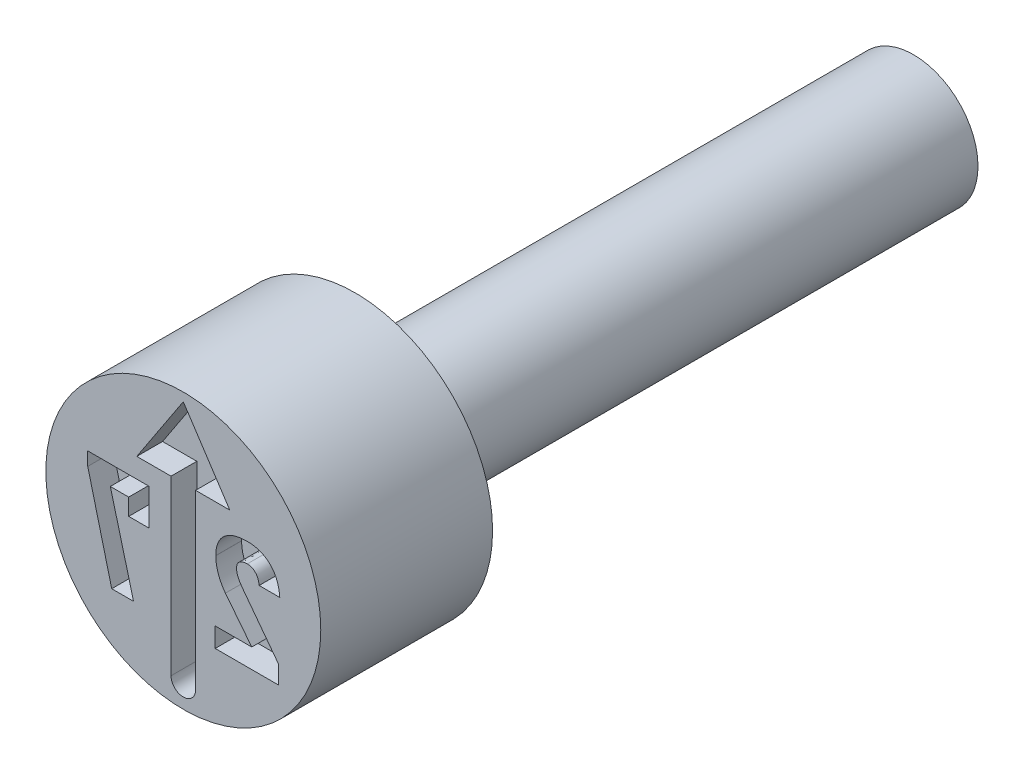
ISO-10303-21;
HEADER;
FILE_DESCRIPTION(('STEP AP214'),'2;1');
FILE_NAME('part.step','',(''),(''),'','','');
FILE_SCHEMA(('AUTOMOTIVE_DESIGN { 1 0 10303 214 1 1 1 1 }'));
ENDSEC;
DATA;
#1=APPLICATION_CONTEXT('core data for automotive mechanical design processes');
#2=APPLICATION_PROTOCOL_DEFINITION('international standard','automotive_design',2000,#1);
#3=PRODUCT_CONTEXT('',#1,'mechanical');
#4=PRODUCT('Part','Part','',(#3));
#5=PRODUCT_RELATED_PRODUCT_CATEGORY('part','',(#4));
#6=PRODUCT_DEFINITION_FORMATION('','',#4);
#7=PRODUCT_DEFINITION_CONTEXT('part definition',#1,'design');
#8=PRODUCT_DEFINITION('design','',#6,#7);
#9=PRODUCT_DEFINITION_SHAPE('','',#8);
#10=(LENGTH_UNIT() NAMED_UNIT(*) SI_UNIT(.MILLI.,.METRE.));
#11=(NAMED_UNIT(*) PLANE_ANGLE_UNIT() SI_UNIT($,.RADIAN.));
#12=(NAMED_UNIT(*) SI_UNIT($,.STERADIAN.) SOLID_ANGLE_UNIT());
#13=UNCERTAINTY_MEASURE_WITH_UNIT(LENGTH_MEASURE(1.E-05),#10,'distance_accuracy_value','');
#14=(GEOMETRIC_REPRESENTATION_CONTEXT(3) GLOBAL_UNCERTAINTY_ASSIGNED_CONTEXT((#13)) GLOBAL_UNIT_ASSIGNED_CONTEXT((#10,
#11,#12)) REPRESENTATION_CONTEXT('',''));
#15=CARTESIAN_POINT('',(0.,0.,0.));
#16=DIRECTION('',(0.,0.,1.));
#17=DIRECTION('',(1.,0.,0.));
#18=AXIS2_PLACEMENT_3D('',#15,#16,#17);
#19=CARTESIAN_POINT('',(0.,1.5,-4.));
#20=DIRECTION('',(0.,0.,1.));
#21=DIRECTION('',(1.,0.,0.));
#22=AXIS2_PLACEMENT_3D('',#19,#20,#21);
#23=PLANE('',#22);
#24=CARTESIAN_POINT('',(0.,0.,-4.));
#25=DIRECTION('',(0.,0.,1.));
#26=DIRECTION('',(1.,0.,0.));
#27=AXIS2_PLACEMENT_3D('',#24,#25,#26);
#28=CIRCLE('',#27,3.2);
#29=CARTESIAN_POINT('',(3.2,0.,-4.));
#30=VERTEX_POINT('',#29);
#31=EDGE_CURVE('E11',#30,#30,#28,.T.);
#32=ORIENTED_EDGE('',*,*,#31,.F.);
#33=EDGE_LOOP('',(#32));
#34=FACE_BOUND('',#33,.T.);
#35=CARTESIAN_POINT('',(0.,0.,-4.));
#36=DIRECTION('',(0.,0.,1.));
#37=DIRECTION('',(1.,0.,0.));
#38=AXIS2_PLACEMENT_3D('',#35,#36,#37);
#39=CIRCLE('',#38,1.5);
#40=CARTESIAN_POINT('',(1.5,0.,-4.));
#41=VERTEX_POINT('',#40);
#42=EDGE_CURVE('E405',#41,#41,#39,.T.);
#43=ORIENTED_EDGE('',*,*,#42,.T.);
#44=EDGE_LOOP('',(#43));
#45=FACE_BOUND('',#44,.T.);
#46=ADVANCED_FACE('F39',(#34,#45),#23,.F.);
#47=CARTESIAN_POINT('',(0.,0.,-0.403888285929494));
#48=DIRECTION('',(0.,0.,1.));
#49=DIRECTION('',(1.,0.,0.));
#50=AXIS2_PLACEMENT_3D('',#47,#48,#49);
#51=CYLINDRICAL_SURFACE('',#50,3.2);
#52=CARTESIAN_POINT('',(0.,0.,0.));
#53=DIRECTION('',(0.,0.,1.));
#54=DIRECTION('',(1.,0.,0.));
#55=AXIS2_PLACEMENT_3D('',#52,#53,#54);
#56=CIRCLE('',#55,3.2);
#57=CARTESIAN_POINT('',(3.2,0.,0.));
#58=VERTEX_POINT('',#57);
#59=EDGE_CURVE('E46',#58,#58,#56,.T.);
#60=ORIENTED_EDGE('',*,*,#59,.F.);
#61=EDGE_LOOP('',(#60));
#62=FACE_BOUND('',#61,.T.);
#63=ORIENTED_EDGE('',*,*,#31,.T.);
#64=EDGE_LOOP('',(#63));
#65=FACE_BOUND('',#64,.T.);
#66=ADVANCED_FACE('F390',(#62,#65),#51,.T.);
#67=CARTESIAN_POINT('',(0.,3.2,0.));
#68=DIRECTION('',(0.,0.,-1.));
#69=DIRECTION('',(-1.,0.,0.));
#70=AXIS2_PLACEMENT_3D('',#67,#68,#69);
#71=PLANE('',#70);
#72=DIRECTION('',(0.,1.,0.));
#73=VECTOR('',#72,1.);
#74=CARTESIAN_POINT('',(2.2148336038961,-1.6,0.));
#75=LINE('',#74,#73);
#76=CARTESIAN_POINT('',(2.2148336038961,-1.6,0.));
#77=VERTEX_POINT('',#76);
#78=CARTESIAN_POINT('',(2.2148336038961,-1.17487824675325,0.));
#79=VERTEX_POINT('',#78);
#80=EDGE_CURVE('E640',#77,#79,#75,.T.);
#81=ORIENTED_EDGE('',*,*,#80,.F.);
#82=DIRECTION('',(1.,0.,0.));
#83=VECTOR('',#82,1.);
#84=CARTESIAN_POINT('',(0.742633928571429,-1.6,0.));
#85=LINE('',#84,#83);
#86=CARTESIAN_POINT('',(0.742633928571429,-1.6,0.));
#87=VERTEX_POINT('',#86);
#88=EDGE_CURVE('E53',#87,#77,#85,.T.);
#89=ORIENTED_EDGE('',*,*,#88,.F.);
#90=DIRECTION('',(0.,-1.,0.));
#91=VECTOR('',#90,1.);
#92=CARTESIAN_POINT('',(0.742633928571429,-1.14545454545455,0.));
#93=LINE('',#92,#91);
#94=CARTESIAN_POINT('',(0.742633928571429,-1.14545454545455,0.));
#95=VERTEX_POINT('',#94);
#96=EDGE_CURVE('E274',#95,#87,#93,.T.);
#97=ORIENTED_EDGE('',*,*,#96,.F.);
#98=DIRECTION('',(-1.,0.,0.));
#99=VECTOR('',#98,1.);
#100=CARTESIAN_POINT('',(1.59338474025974,-1.14545454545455,0.));
#101=LINE('',#100,#99);
#102=CARTESIAN_POINT('',(1.59338474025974,-1.14545454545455,0.));
#103=VERTEX_POINT('',#102);
#104=EDGE_CURVE('E277',#103,#95,#101,.T.);
#105=ORIENTED_EDGE('',*,*,#104,.F.);
#106=DIRECTION('',(0.618183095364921,-0.786034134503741,0.));
#107=VECTOR('',#106,1.);
#108=CARTESIAN_POINT('',(0.980560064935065,-0.366233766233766,0.));
#109=LINE('',#108,#107);
#110=CARTESIAN_POINT('',(0.980560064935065,-0.366233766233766,0.));
#111=VERTEX_POINT('',#110);
#112=EDGE_CURVE('E571',#111,#103,#109,.T.);
#113=ORIENTED_EDGE('',*,*,#112,.F.);
#114=CARTESIAN_POINT('',(0.756331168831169,0.277029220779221,0.));
#115=CARTESIAN_POINT('',(0.756977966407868,0.2485838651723,0.));
#116=CARTESIAN_POINT('',(0.758272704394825,0.19164289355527,0.));
#117=CARTESIAN_POINT('',(0.76995979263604,0.106422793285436,0.));
#118=CARTESIAN_POINT('',(0.788793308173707,0.0216377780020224,0.));
#119=CARTESIAN_POINT('',(0.814658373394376,-0.0623025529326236,0.));
#120=CARTESIAN_POINT('',(0.846789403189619,-0.143944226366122,0.));
#121=CARTESIAN_POINT('',(0.885352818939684,-0.222169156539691,0.));
#122=CARTESIAN_POINT('',(0.928876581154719,-0.297011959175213,0.));
#123=CARTESIAN_POINT('',(0.96336522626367,-0.343204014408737,0.));
#124=CARTESIAN_POINT('',(0.980560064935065,-0.366233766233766,0.));
#125=B_SPLINE_CURVE_WITH_KNOTS('',3,(#114,#115,#116,#117,#118,#119,#120,#121,#122,#123,#124),
.UNSPECIFIED.,.F.,.F.,(4,1,1,1,1,1,1,1,4),(0.,0.123046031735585,0.246309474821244,
0.371480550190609,0.498560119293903,0.626024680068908,0.750715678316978,0.875715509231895,1.),.UNSPECIFIED.);
#126=CARTESIAN_POINT('',(0.756331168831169,0.277029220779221,0.));
#127=VERTEX_POINT('',#126);
#128=EDGE_CURVE('E574',#127,#111,#125,.T.);
#129=ORIENTED_EDGE('',*,*,#128,.F.);
#130=DIRECTION('',(0.,-1.,0.));
#131=VECTOR('',#130,1.);
#132=CARTESIAN_POINT('',(0.756331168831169,0.279058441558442,0.));
#133=LINE('',#132,#131);
#134=CARTESIAN_POINT('',(0.756331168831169,0.279058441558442,0.));
#135=VERTEX_POINT('',#134);
#136=EDGE_CURVE('E579',#135,#127,#133,.T.);
#137=ORIENTED_EDGE('',*,*,#136,.F.);
#138=CARTESIAN_POINT('',(1.49243100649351,0.932467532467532,0.));
#139=CARTESIAN_POINT('',(1.46399898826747,0.932063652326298,0.));
#140=CARTESIAN_POINT('',(1.40870247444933,0.931278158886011,0.));
#141=CARTESIAN_POINT('',(1.32820031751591,0.922799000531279,0.));
#142=CARTESIAN_POINT('',(1.25245632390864,0.91000147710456,0.));
#143=CARTESIAN_POINT('',(1.18159237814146,0.891279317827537,0.));
#144=CARTESIAN_POINT('',(1.11589296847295,0.866857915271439,0.));
#145=CARTESIAN_POINT('',(1.0551612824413,0.837411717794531,0.));
#146=CARTESIAN_POINT('',(0.99927036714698,0.802689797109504,0.));
#147=CARTESIAN_POINT('',(0.948648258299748,0.762617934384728,0.));
#148=CARTESIAN_POINT('',(0.903100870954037,0.717924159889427,0.));
#149=CARTESIAN_POINT('',(0.863896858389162,0.668154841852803,0.));
#150=CARTESIAN_POINT('',(0.829959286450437,0.614316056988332,0.));
#151=CARTESIAN_POINT('',(0.803430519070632,0.555363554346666,0.));
#152=CARTESIAN_POINT('',(0.78158990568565,0.492683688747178,0.));
#153=CARTESIAN_POINT('',(0.767448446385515,0.425152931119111,0.));
#154=CARTESIAN_POINT('',(0.757918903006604,0.353566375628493,0.));
#155=CARTESIAN_POINT('',(0.75686879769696,0.304287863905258,0.));
#156=CARTESIAN_POINT('',(0.756331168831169,0.279058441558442,0.));
#157=B_SPLINE_CURVE_WITH_KNOTS('',3,(#138,#139,#140,#141,#142,#143,#144,#145,#146,#147,#148,
#149,#150,#151,#152,#153,#154,#155,#156),.UNSPECIFIED.,.F.,.F.,(4,1,1,1,1,1,1,1,1,1,1,1,1,1,1,1,
4),(0.,0.0762312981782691,0.148259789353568,0.216860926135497,0.28210063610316,
0.344528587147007,0.404571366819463,0.462840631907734,0.520642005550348,0.577409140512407,
0.633580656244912,0.690215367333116,0.747647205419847,0.806597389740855,0.867894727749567,
0.932365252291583,1.),.UNSPECIFIED.);
#158=CARTESIAN_POINT('',(1.49243100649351,0.932467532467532,0.));
#159=VERTEX_POINT('',#158);
#160=EDGE_CURVE('E585',#159,#135,#157,.T.);
#161=ORIENTED_EDGE('',*,*,#160,.F.);
#162=CARTESIAN_POINT('',(2.24577922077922,0.182163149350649,0.));
#163=CARTESIAN_POINT('',(2.24340615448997,0.211141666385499,0.));
#164=CARTESIAN_POINT('',(2.23877397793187,0.267707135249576,0.));
#165=CARTESIAN_POINT('',(2.22358769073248,0.349531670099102,0.));
#166=CARTESIAN_POINT('',(2.20396001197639,0.426604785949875,0.));
#167=CARTESIAN_POINT('',(2.178990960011,0.498911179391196,0.));
#168=CARTESIAN_POINT('',(2.14690563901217,0.565613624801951,0.));
#169=CARTESIAN_POINT('',(2.11085680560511,0.6281065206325,0.));
#170=CARTESIAN_POINT('',(2.06749909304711,0.684456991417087,0.));
#171=CARTESIAN_POINT('',(2.02003800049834,0.736550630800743,0.));
#172=CARTESIAN_POINT('',(1.96717483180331,0.78243395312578,0.));
#173=CARTESIAN_POINT('',(1.91080816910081,0.822909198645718,0.));
#174=CARTESIAN_POINT('',(1.85008565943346,0.856591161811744,0.));
#175=CARTESIAN_POINT('',(1.78593044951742,0.884532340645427,0.));
#176=CARTESIAN_POINT('',(1.71763124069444,0.905738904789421,0.));
#177=CARTESIAN_POINT('',(1.64608018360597,0.921624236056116,0.));
#178=CARTESIAN_POINT('',(1.57045600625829,0.930785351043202,0.));
#179=CARTESIAN_POINT('',(1.51883538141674,0.931898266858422,0.));
#180=CARTESIAN_POINT('',(1.49243100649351,0.932467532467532,0.));
#181=B_SPLINE_CURVE_WITH_KNOTS('',3,(#162,#163,#164,#165,#166,#167,#168,#169,#170,#171,#172,
#173,#174,#175,#176,#177,#178,#179,#180),.UNSPECIFIED.,.F.,.F.,(4,1,1,1,1,1,1,1,1,1,1,1,1,1,1,1,
4),(0.,0.073326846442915,0.14313249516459,0.209679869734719,0.273918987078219,0.33576228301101,
0.396210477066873,0.45560885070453,0.514796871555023,0.573764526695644,0.631900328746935,
0.689592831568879,0.748648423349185,0.808163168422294,0.86976604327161,0.933384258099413,1.),.UNSPECIFIED.);
#182=CARTESIAN_POINT('',(2.24577922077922,0.182163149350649,0.));
#183=VERTEX_POINT('',#182);
#184=EDGE_CURVE('E590',#183,#159,#181,.T.);
#185=ORIENTED_EDGE('',*,*,#184,.F.);
#186=DIRECTION('',(0.,1.,0.));
#187=VECTOR('',#186,1.);
#188=CARTESIAN_POINT('',(2.24577922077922,0.180641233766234,0.));
#189=LINE('',#188,#187);
#190=CARTESIAN_POINT('',(2.24577922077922,0.180641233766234,0.));
#191=VERTEX_POINT('',#190);
#192=EDGE_CURVE('E598',#191,#183,#189,.T.);
#193=ORIENTED_EDGE('',*,*,#192,.F.);
#194=DIRECTION('',(1.,0.,0.));
#195=VECTOR('',#194,1.);
#196=CARTESIAN_POINT('',(1.7648538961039,0.180641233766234,0.));
#197=LINE('',#196,#195);
#198=CARTESIAN_POINT('',(1.7648538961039,0.180641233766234,0.));
#199=VERTEX_POINT('',#198);
#200=EDGE_CURVE('E604',#199,#191,#197,.T.);
#201=ORIENTED_EDGE('',*,*,#200,.F.);
#202=DIRECTION('',(0.,-1.,0.));
#203=VECTOR('',#202,1.);
#204=CARTESIAN_POINT('',(1.7648538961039,0.182163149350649,0.));
#205=LINE('',#204,#203);
#206=CARTESIAN_POINT('',(1.7648538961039,0.182163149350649,0.));
#207=VERTEX_POINT('',#206);
#208=EDGE_CURVE('E607',#207,#199,#205,.T.);
#209=ORIENTED_EDGE('',*,*,#208,.F.);
#210=CARTESIAN_POINT('',(1.48887987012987,0.477922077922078,0.));
#211=CARTESIAN_POINT('',(1.50725853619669,0.477204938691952,0.));
#212=CARTESIAN_POINT('',(1.54296892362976,0.47581151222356,0.));
#213=CARTESIAN_POINT('',(1.59352306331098,0.460368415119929,0.));
#214=CARTESIAN_POINT('',(1.63907727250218,0.436144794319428,0.));
#215=CARTESIAN_POINT('',(1.67834861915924,0.401580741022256,0.));
#216=CARTESIAN_POINT('',(1.71086826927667,0.358184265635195,0.));
#217=CARTESIAN_POINT('',(1.7372611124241,0.307081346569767,0.));
#218=CARTESIAN_POINT('',(1.75518693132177,0.247349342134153,0.));
#219=CARTESIAN_POINT('',(1.76152788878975,0.204591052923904,0.));
#220=CARTESIAN_POINT('',(1.7648538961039,0.182163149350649,0.));
#221=B_SPLINE_CURVE_WITH_KNOTS('',3,(#210,#211,#212,#213,#214,#215,#216,#217,#218,#219,#220),
.UNSPECIFIED.,.F.,.F.,(4,1,1,1,1,1,1,1,4),(0.,0.122603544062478,0.238222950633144,
0.350089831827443,0.465559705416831,0.58502806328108,0.711014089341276,0.848418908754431,1.),.UNSPECIFIED.);
#222=CARTESIAN_POINT('',(1.48887987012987,0.477922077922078,0.));
#223=VERTEX_POINT('',#222);
#224=EDGE_CURVE('E610',#223,#207,#221,.T.);
#225=ORIENTED_EDGE('',*,*,#224,.F.);
#226=CARTESIAN_POINT('',(1.23928571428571,0.265868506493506,0.));
#227=CARTESIAN_POINT('',(1.23997872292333,0.281853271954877,0.));
#228=CARTESIAN_POINT('',(1.24130641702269,0.31247753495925,0.));
#229=CARTESIAN_POINT('',(1.25381537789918,0.355627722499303,0.));
#230=CARTESIAN_POINT('',(1.27431689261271,0.393204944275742,0.));
#231=CARTESIAN_POINT('',(1.30368001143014,0.424243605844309,0.));
#232=CARTESIAN_POINT('',(1.34023484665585,0.44879331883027,0.));
#233=CARTESIAN_POINT('',(1.3839737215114,0.466094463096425,0.));
#234=CARTESIAN_POINT('',(1.43432434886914,0.476015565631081,0.));
#235=CARTESIAN_POINT('',(1.47006304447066,0.477264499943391,0.));
#236=CARTESIAN_POINT('',(1.48887987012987,0.477922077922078,0.));
#237=B_SPLINE_CURVE_WITH_KNOTS('',3,(#226,#227,#228,#229,#230,#231,#232,#233,#234,#235,#236),
.UNSPECIFIED.,.F.,.F.,(4,1,1,1,1,1,1,1,4),(0.,0.128749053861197,0.246662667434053,
0.359069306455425,0.47107757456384,0.588039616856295,0.711712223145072,0.848213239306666,1.),.UNSPECIFIED.);
#238=CARTESIAN_POINT('',(1.23928571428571,0.265868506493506,0.));
#239=VERTEX_POINT('',#238);
#240=EDGE_CURVE('E615',#239,#223,#237,.T.);
#241=ORIENTED_EDGE('',*,*,#240,.F.);
#242=DIRECTION('',(0.,1.,0.));
#243=VECTOR('',#242,1.);
#244=CARTESIAN_POINT('',(1.23928571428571,0.26231737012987,0.));
#245=LINE('',#244,#243);
#246=CARTESIAN_POINT('',(1.23928571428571,0.26231737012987,0.));
#247=VERTEX_POINT('',#246);
#248=EDGE_CURVE('E623',#247,#239,#245,.T.);
#249=ORIENTED_EDGE('',*,*,#248,.F.);
#250=CARTESIAN_POINT('',(1.36053165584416,-0.0430803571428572,0.));
#251=CARTESIAN_POINT('',(1.34263815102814,-0.0178674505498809,0.));
#252=CARTESIAN_POINT('',(1.30777320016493,0.0312591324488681,0.));
#253=CARTESIAN_POINT('',(1.27621773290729,0.0987245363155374,0.));
#254=CARTESIAN_POINT('',(1.25655998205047,0.15161825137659,0.));
#255=CARTESIAN_POINT('',(1.2471915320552,0.189976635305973,0.));
#256=CARTESIAN_POINT('',(1.2405083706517,0.226574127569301,0.));
#257=CARTESIAN_POINT('',(1.23968578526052,0.250621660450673,0.));
#258=CARTESIAN_POINT('',(1.23928571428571,0.26231737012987,0.));
#259=B_SPLINE_CURVE_WITH_KNOTS('',3,(#250,#251,#252,#253,#254,#255,#256,#257,#258),
.UNSPECIFIED.,.F.,.F.,(4,1,1,1,1,1,4),(0.,0.277375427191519,0.540457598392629,0.666416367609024,
0.784009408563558,0.894951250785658,1.),.UNSPECIFIED.);
#260=CARTESIAN_POINT('',(1.36053165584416,-0.0430803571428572,0.));
#261=VERTEX_POINT('',#260);
#262=EDGE_CURVE('E629',#261,#247,#259,.T.);
#263=ORIENTED_EDGE('',*,*,#262,.F.);
#264=DIRECTION('',(-0.602458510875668,0.798150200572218,0.));
#265=VECTOR('',#264,1.);
#266=CARTESIAN_POINT('',(2.2148336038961,-1.17487824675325,0.));
#267=LINE('',#266,#265);
#268=EDGE_CURVE('E634',#79,#261,#267,.T.);
#269=ORIENTED_EDGE('',*,*,#268,.F.);
#270=EDGE_LOOP('',(#81,#89,#97,#105,#113,#129,#137,#161,#185,#193,#201,#209,#225,#241,#249,#263,#269));
#271=FACE_BOUND('',#270,.T.);
#272=DIRECTION('',(0.,-1.,0.));
#273=VECTOR('',#272,1.);
#274=CARTESIAN_POINT('',(-2.22443181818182,0.9,0.));
#275=LINE('',#274,#273);
#276=CARTESIAN_POINT('',(-2.22443181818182,0.9,0.));
#277=VERTEX_POINT('',#276);
#278=CARTESIAN_POINT('',(-2.22443181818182,0.58648538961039,0.));
#279=VERTEX_POINT('',#278);
#280=EDGE_CURVE('E510',#277,#279,#275,.T.);
#281=ORIENTED_EDGE('',*,*,#280,.F.);
#282=DIRECTION('',(-1.,0.,0.));
#283=VECTOR('',#282,1.);
#284=CARTESIAN_POINT('',(-0.801948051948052,0.9,0.));
#285=LINE('',#284,#283);
#286=CARTESIAN_POINT('',(-0.801948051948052,0.9,0.));
#287=VERTEX_POINT('',#286);
#288=EDGE_CURVE('E61',#287,#277,#285,.T.);
#289=ORIENTED_EDGE('',*,*,#288,.F.);
#290=DIRECTION('',(0.,1.,0.));
#291=VECTOR('',#290,1.);
#292=CARTESIAN_POINT('',(-0.801948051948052,0.0558441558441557,0.));
#293=LINE('',#292,#291);
#294=CARTESIAN_POINT('',(-0.801948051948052,0.0558441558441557,0.));
#295=VERTEX_POINT('',#294);
#296=EDGE_CURVE('E488',#295,#287,#293,.T.);
#297=ORIENTED_EDGE('',*,*,#296,.F.);
#298=DIRECTION('',(1.,0.,0.));
#299=VECTOR('',#298,1.);
#300=CARTESIAN_POINT('',(-1.27120535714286,0.0558441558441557,0.));
#301=LINE('',#300,#299);
#302=CARTESIAN_POINT('',(-1.27120535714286,0.0558441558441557,0.));
#303=VERTEX_POINT('',#302);
#304=EDGE_CURVE('E492',#303,#295,#301,.T.);
#305=ORIENTED_EDGE('',*,*,#304,.F.);
#306=DIRECTION('',(0.,-1.,0.));
#307=VECTOR('',#306,1.);
#308=CARTESIAN_POINT('',(-1.27120535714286,0.445454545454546,0.));
#309=LINE('',#308,#307);
#310=CARTESIAN_POINT('',(-1.27120535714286,0.445454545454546,0.));
#311=VERTEX_POINT('',#310);
#312=EDGE_CURVE('E495',#311,#303,#309,.T.);
#313=ORIENTED_EDGE('',*,*,#312,.F.);
#314=DIRECTION('',(1.,0.,0.));
#315=VECTOR('',#314,1.);
#316=CARTESIAN_POINT('',(-1.69886363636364,0.445454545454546,0.));
#317=LINE('',#316,#315);
#318=CARTESIAN_POINT('',(-1.69886363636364,0.445454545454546,0.));
#319=VERTEX_POINT('',#318);
#320=EDGE_CURVE('E498',#319,#311,#317,.T.);
#321=ORIENTED_EDGE('',*,*,#320,.F.);
#322=DIRECTION('',(-0.255602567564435,0.966781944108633,0.));
#323=VECTOR('',#322,1.);
#324=CARTESIAN_POINT('',(-1.1580762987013,-1.6,0.));
#325=LINE('',#324,#323);
#326=CARTESIAN_POINT('',(-1.1580762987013,-1.6,0.));
#327=VERTEX_POINT('',#326);
#328=EDGE_CURVE('E501',#327,#319,#325,.T.);
#329=ORIENTED_EDGE('',*,*,#328,.F.);
#330=DIRECTION('',(1.,0.,0.));
#331=VECTOR('',#330,1.);
#332=CARTESIAN_POINT('',(-1.6663961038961,-1.6,0.));
#333=LINE('',#332,#331);
#334=CARTESIAN_POINT('',(-1.6663961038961,-1.6,0.));
#335=VERTEX_POINT('',#334);
#336=EDGE_CURVE('E504',#335,#327,#333,.T.);
#337=ORIENTED_EDGE('',*,*,#336,.F.);
#338=DIRECTION('',(0.247293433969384,-0.968940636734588,0.));
#339=VECTOR('',#338,1.);
#340=CARTESIAN_POINT('',(-2.22443181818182,0.58648538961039,0.));
#341=LINE('',#340,#339);
#342=EDGE_CURVE('E507',#279,#335,#341,.T.);
#343=ORIENTED_EDGE('',*,*,#342,.F.);
#344=EDGE_LOOP('',(#281,#289,#297,#305,#313,#321,#329,#337,#343));
#345=FACE_BOUND('',#344,.T.);
#346=DIRECTION('',(0.,1.,0.));
#347=VECTOR('',#346,1.);
#348=CARTESIAN_POINT('',(0.28570968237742,1.35952714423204,0.));
#349=LINE('',#348,#347);
#350=CARTESIAN_POINT('',(0.285709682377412,-2.66424275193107,0.));
#351=VERTEX_POINT('',#350);
#352=CARTESIAN_POINT('',(0.28570968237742,1.35952714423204,0.));
#353=VERTEX_POINT('',#352);
#354=EDGE_CURVE('E444',#351,#353,#349,.T.);
#355=ORIENTED_EDGE('',*,*,#354,.F.);
#356=CARTESIAN_POINT('',(2.4513673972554E-13,-2.66424275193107,0.));
#357=DIRECTION('',(0.,0.,1.));
#358=DIRECTION('',(1.,0.,0.));
#359=AXIS2_PLACEMENT_3D('',#356,#357,#358);
#360=CIRCLE('',#359,0.285709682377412);
#361=CARTESIAN_POINT('',(-0.285709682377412,-2.66424275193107,0.));
#362=VERTEX_POINT('',#361);
#363=EDGE_CURVE('E447',#362,#351,#360,.T.);
#364=ORIENTED_EDGE('',*,*,#363,.F.);
#365=DIRECTION('',(0.,-1.,0.));
#366=VECTOR('',#365,1.);
#367=CARTESIAN_POINT('',(-0.28570968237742,1.35952714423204,0.));
#368=LINE('',#367,#366);
#369=CARTESIAN_POINT('',(-0.28570968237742,1.35952714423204,0.));
#370=VERTEX_POINT('',#369);
#371=EDGE_CURVE('E428',#370,#362,#368,.T.);
#372=ORIENTED_EDGE('',*,*,#371,.F.);
#373=DIRECTION('',(1.,0.,0.));
#374=VECTOR('',#373,1.);
#375=CARTESIAN_POINT('',(-1.08287651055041,1.35952714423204,0.));
#376=LINE('',#375,#374);
#377=CARTESIAN_POINT('',(-1.08287651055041,1.35952714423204,0.));
#378=VERTEX_POINT('',#377);
#379=EDGE_CURVE('E432',#378,#370,#376,.T.);
#380=ORIENTED_EDGE('',*,*,#379,.F.);
#381=DIRECTION('',(-0.550159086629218,-0.835059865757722,0.));
#382=VECTOR('',#381,1.);
#383=CARTESIAN_POINT('',(0.,3.00317301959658,0.));
#384=LINE('',#383,#382);
#385=CARTESIAN_POINT('',(0.,3.00317301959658,0.));
#386=VERTEX_POINT('',#385);
#387=EDGE_CURVE('E435',#386,#378,#384,.T.);
#388=ORIENTED_EDGE('',*,*,#387,.F.);
#389=DIRECTION('',(-0.550159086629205,0.835059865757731,0.));
#390=VECTOR('',#389,1.);
#391=CARTESIAN_POINT('',(0.,3.00317301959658,0.));
#392=LINE('',#391,#390);
#393=CARTESIAN_POINT('',(1.08287651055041,1.35952714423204,0.));
#394=VERTEX_POINT('',#393);
#395=EDGE_CURVE('E438',#394,#386,#392,.T.);
#396=ORIENTED_EDGE('',*,*,#395,.F.);
#397=DIRECTION('',(1.,0.,0.));
#398=VECTOR('',#397,1.);
#399=CARTESIAN_POINT('',(1.08287651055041,1.35952714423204,0.));
#400=LINE('',#399,#398);
#401=EDGE_CURVE('E441',#353,#394,#400,.T.);
#402=ORIENTED_EDGE('',*,*,#401,.F.);
#403=EDGE_LOOP('',(#355,#364,#372,#380,#388,#396,#402));
#404=FACE_BOUND('',#403,.T.);
#405=ORIENTED_EDGE('',*,*,#59,.T.);
#406=EDGE_LOOP('',(#405));
#407=FACE_BOUND('',#406,.T.);
#408=ADVANCED_FACE('F387',(#271,#345,#404,#407),#71,.F.);
#409=CARTESIAN_POINT('',(0.,0.,-17.));
#410=DIRECTION('',(0.,0.,1.));
#411=DIRECTION('',(1.,0.,0.));
#412=AXIS2_PLACEMENT_3D('',#409,#410,#411);
#413=PLANE('',#412);
#414=CARTESIAN_POINT('',(0.,0.,-17.));
#415=DIRECTION('',(0.,0.,1.));
#416=DIRECTION('',(1.,0.,0.));
#417=AXIS2_PLACEMENT_3D('',#414,#415,#416);
#418=CIRCLE('',#417,1.5);
#419=CARTESIAN_POINT('',(1.5,0.,-17.));
#420=VERTEX_POINT('',#419);
#421=EDGE_CURVE('E406',#420,#420,#418,.T.);
#422=ORIENTED_EDGE('',*,*,#421,.F.);
#423=EDGE_LOOP('',(#422));
#424=FACE_BOUND('',#423,.T.);
#425=ADVANCED_FACE('F383',(#424),#413,.F.);
#426=CARTESIAN_POINT('',(0.,0.,-0.403888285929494));
#427=DIRECTION('',(0.,0.,1.));
#428=DIRECTION('',(1.,0.,0.));
#429=AXIS2_PLACEMENT_3D('',#426,#427,#428);
#430=CYLINDRICAL_SURFACE('',#429,1.5);
#431=ORIENTED_EDGE('',*,*,#42,.F.);
#432=EDGE_LOOP('',(#431));
#433=FACE_BOUND('',#432,.T.);
#434=ORIENTED_EDGE('',*,*,#421,.T.);
#435=EDGE_LOOP('',(#434));
#436=FACE_BOUND('',#435,.T.);
#437=ADVANCED_FACE('F379',(#433,#436),#430,.T.);
#438=CARTESIAN_POINT('',(2.4513673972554E-13,-2.66424275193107,-0.6));
#439=DIRECTION('',(0.,0.,1.));
#440=DIRECTION('',(1.,0.,0.));
#441=AXIS2_PLACEMENT_3D('',#438,#439,#440);
#442=CYLINDRICAL_SURFACE('',#441,0.285709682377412);
#443=ORIENTED_EDGE('',*,*,#363,.T.);
#444=DIRECTION('',(0.,0.,1.));
#445=VECTOR('',#444,1.);
#446=CARTESIAN_POINT('',(0.285709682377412,-2.66424275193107,-0.6));
#447=LINE('',#446,#445);
#448=CARTESIAN_POINT('',(0.285709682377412,-2.66424275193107,-0.6));
#449=VERTEX_POINT('',#448);
#450=EDGE_CURVE('E414',#449,#351,#447,.T.);
#451=ORIENTED_EDGE('',*,*,#450,.F.);
#452=CARTESIAN_POINT('',(2.4513673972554E-13,-2.66424275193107,-0.6));
#453=DIRECTION('',(0.,0.,1.));
#454=DIRECTION('',(1.,0.,0.));
#455=AXIS2_PLACEMENT_3D('',#452,#453,#454);
#456=CIRCLE('',#455,0.285709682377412);
#457=CARTESIAN_POINT('',(-0.285709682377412,-2.66424275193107,-0.6));
#458=VERTEX_POINT('',#457);
#459=EDGE_CURVE('E431',#458,#449,#456,.T.);
#460=ORIENTED_EDGE('',*,*,#459,.F.);
#461=DIRECTION('',(0.,0.,1.));
#462=VECTOR('',#461,1.);
#463=CARTESIAN_POINT('',(-0.285709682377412,-2.66424275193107,-0.6));
#464=LINE('',#463,#462);
#465=EDGE_CURVE('E407',#458,#362,#464,.T.);
#466=ORIENTED_EDGE('',*,*,#465,.T.);
#467=EDGE_LOOP('',(#443,#451,#460,#466));
#468=FACE_BOUND('',#467,.T.);
#469=ADVANCED_FACE('F357',(#468),#442,.F.);
#470=CARTESIAN_POINT('',(-0.28570968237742,1.35952714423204,-0.6));
#471=DIRECTION('',(-1.,0.,0.));
#472=DIRECTION('',(0.,-1.,0.));
#473=AXIS2_PLACEMENT_3D('',#470,#471,#472);
#474=PLANE('',#473);
#475=ORIENTED_EDGE('',*,*,#371,.T.);
#476=ORIENTED_EDGE('',*,*,#465,.F.);
#477=DIRECTION('',(0.,-1.,0.));
#478=VECTOR('',#477,1.);
#479=CARTESIAN_POINT('',(-0.28570968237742,1.35952714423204,-0.6));
#480=LINE('',#479,#478);
#481=CARTESIAN_POINT('',(-0.28570968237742,1.35952714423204,-0.6));
#482=VERTEX_POINT('',#481);
#483=EDGE_CURVE('E419',#482,#458,#480,.T.);
#484=ORIENTED_EDGE('',*,*,#483,.F.);
#485=DIRECTION('',(0.,0.,1.));
#486=VECTOR('',#485,1.);
#487=CARTESIAN_POINT('',(-0.28570968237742,1.35952714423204,-0.6));
#488=LINE('',#487,#486);
#489=EDGE_CURVE('E411',#482,#370,#488,.T.);
#490=ORIENTED_EDGE('',*,*,#489,.T.);
#491=EDGE_LOOP('',(#475,#476,#484,#490));
#492=FACE_BOUND('',#491,.T.);
#493=ADVANCED_FACE('F353',(#492),#474,.F.);
#494=CARTESIAN_POINT('',(-1.08287651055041,1.35952714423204,-0.6));
#495=DIRECTION('',(0.,-1.,0.));
#496=DIRECTION('',(0.,0.,-1.));
#497=AXIS2_PLACEMENT_3D('',#494,#495,#496);
#498=PLANE('',#497);
#499=ORIENTED_EDGE('',*,*,#379,.T.);
#500=ORIENTED_EDGE('',*,*,#489,.F.);
#501=DIRECTION('',(1.,0.,0.));
#502=VECTOR('',#501,1.);
#503=CARTESIAN_POINT('',(-1.08287651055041,1.35952714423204,-0.6));
#504=LINE('',#503,#502);
#505=CARTESIAN_POINT('',(-1.08287651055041,1.35952714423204,-0.6));
#506=VERTEX_POINT('',#505);
#507=EDGE_CURVE('E452',#506,#482,#504,.T.);
#508=ORIENTED_EDGE('',*,*,#507,.F.);
#509=DIRECTION('',(0.,0.,1.));
#510=VECTOR('',#509,1.);
#511=CARTESIAN_POINT('',(-1.08287651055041,1.35952714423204,-0.6));
#512=LINE('',#511,#510);
#513=EDGE_CURVE('E425',#506,#378,#512,.T.);
#514=ORIENTED_EDGE('',*,*,#513,.T.);
#515=EDGE_LOOP('',(#499,#500,#508,#514));
#516=FACE_BOUND('',#515,.T.);
#517=ADVANCED_FACE('F356',(#516),#498,.F.);
#518=CARTESIAN_POINT('',(0.,3.00317301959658,-0.6));
#519=DIRECTION('',(-0.835059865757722,0.550159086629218,0.));
#520=DIRECTION('',(-0.550159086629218,-0.835059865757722,0.));
#521=AXIS2_PLACEMENT_3D('',#518,#519,#520);
#522=PLANE('',#521);
#523=ORIENTED_EDGE('',*,*,#387,.T.);
#524=ORIENTED_EDGE('',*,*,#513,.F.);
#525=DIRECTION('',(-0.550159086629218,-0.835059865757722,0.));
#526=VECTOR('',#525,1.);
#527=CARTESIAN_POINT('',(0.,3.00317301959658,-0.6));
#528=LINE('',#527,#526);
#529=CARTESIAN_POINT('',(0.,3.00317301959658,-0.6));
#530=VERTEX_POINT('',#529);
#531=EDGE_CURVE('E455',#530,#506,#528,.T.);
#532=ORIENTED_EDGE('',*,*,#531,.F.);
#533=DIRECTION('',(0.,0.,1.));
#534=VECTOR('',#533,1.);
#535=CARTESIAN_POINT('',(0.,3.00317301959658,-0.6));
#536=LINE('',#535,#534);
#537=EDGE_CURVE('E423',#530,#386,#536,.T.);
#538=ORIENTED_EDGE('',*,*,#537,.T.);
#539=EDGE_LOOP('',(#523,#524,#532,#538));
#540=FACE_BOUND('',#539,.T.);
#541=ADVANCED_FACE('F361',(#540),#522,.F.);
#542=CARTESIAN_POINT('',(0.,3.00317301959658,-0.6));
#543=DIRECTION('',(0.835059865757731,0.550159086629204,0.));
#544=DIRECTION('',(-0.550159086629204,0.835059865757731,0.));
#545=AXIS2_PLACEMENT_3D('',#542,#543,#544);
#546=PLANE('',#545);
#547=ORIENTED_EDGE('',*,*,#395,.T.);
#548=ORIENTED_EDGE('',*,*,#537,.F.);
#549=DIRECTION('',(-0.550159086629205,0.835059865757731,0.));
#550=VECTOR('',#549,1.);
#551=CARTESIAN_POINT('',(0.,3.00317301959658,-0.6));
#552=LINE('',#551,#550);
#553=CARTESIAN_POINT('',(1.08287651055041,1.35952714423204,-0.6));
#554=VERTEX_POINT('',#553);
#555=EDGE_CURVE('E458',#554,#530,#552,.T.);
#556=ORIENTED_EDGE('',*,*,#555,.F.);
#557=DIRECTION('',(0.,0.,1.));
#558=VECTOR('',#557,1.);
#559=CARTESIAN_POINT('',(1.08287651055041,1.35952714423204,-0.6));
#560=LINE('',#559,#558);
#561=EDGE_CURVE('E421',#554,#394,#560,.T.);
#562=ORIENTED_EDGE('',*,*,#561,.T.);
#563=EDGE_LOOP('',(#547,#548,#556,#562));
#564=FACE_BOUND('',#563,.T.);
#565=ADVANCED_FACE('F365',(#564),#546,.F.);
#566=CARTESIAN_POINT('',(1.08287651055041,1.35952714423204,-0.6));
#567=DIRECTION('',(0.,-1.,0.));
#568=DIRECTION('',(0.,0.,-1.));
#569=AXIS2_PLACEMENT_3D('',#566,#567,#568);
#570=PLANE('',#569);
#571=ORIENTED_EDGE('',*,*,#401,.T.);
#572=ORIENTED_EDGE('',*,*,#561,.F.);
#573=DIRECTION('',(1.,0.,0.));
#574=VECTOR('',#573,1.);
#575=CARTESIAN_POINT('',(1.08287651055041,1.35952714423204,-0.6));
#576=LINE('',#575,#574);
#577=CARTESIAN_POINT('',(0.28570968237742,1.35952714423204,-0.6));
#578=VERTEX_POINT('',#577);
#579=EDGE_CURVE('E461',#578,#554,#576,.T.);
#580=ORIENTED_EDGE('',*,*,#579,.F.);
#581=DIRECTION('',(0.,0.,1.));
#582=VECTOR('',#581,1.);
#583=CARTESIAN_POINT('',(0.28570968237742,1.35952714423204,-0.6));
#584=LINE('',#583,#582);
#585=EDGE_CURVE('E418',#578,#353,#584,.T.);
#586=ORIENTED_EDGE('',*,*,#585,.T.);
#587=EDGE_LOOP('',(#571,#572,#580,#586));
#588=FACE_BOUND('',#587,.T.);
#589=ADVANCED_FACE('F369',(#588),#570,.F.);
#590=CARTESIAN_POINT('',(0.28570968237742,1.35952714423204,-0.6));
#591=DIRECTION('',(1.,0.,0.));
#592=DIRECTION('',(0.,1.,0.));
#593=AXIS2_PLACEMENT_3D('',#590,#591,#592);
#594=PLANE('',#593);
#595=ORIENTED_EDGE('',*,*,#354,.T.);
#596=ORIENTED_EDGE('',*,*,#585,.F.);
#597=DIRECTION('',(0.,1.,0.));
#598=VECTOR('',#597,1.);
#599=CARTESIAN_POINT('',(0.28570968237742,1.35952714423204,-0.6));
#600=LINE('',#599,#598);
#601=EDGE_CURVE('E464',#449,#578,#600,.T.);
#602=ORIENTED_EDGE('',*,*,#601,.F.);
#603=ORIENTED_EDGE('',*,*,#450,.T.);
#604=EDGE_LOOP('',(#595,#596,#602,#603));
#605=FACE_BOUND('',#604,.T.);
#606=ADVANCED_FACE('F351',(#605),#594,.F.);
#607=CARTESIAN_POINT('',(2.4513673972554E-13,-2.66424275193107,-0.6));
#608=DIRECTION('',(0.,0.,1.));
#609=DIRECTION('',(1.,0.,0.));
#610=AXIS2_PLACEMENT_3D('',#607,#608,#609);
#611=PLANE('',#610);
#612=ORIENTED_EDGE('',*,*,#459,.T.);
#613=ORIENTED_EDGE('',*,*,#601,.T.);
#614=ORIENTED_EDGE('',*,*,#579,.T.);
#615=ORIENTED_EDGE('',*,*,#555,.T.);
#616=ORIENTED_EDGE('',*,*,#531,.T.);
#617=ORIENTED_EDGE('',*,*,#507,.T.);
#618=ORIENTED_EDGE('',*,*,#483,.T.);
#619=EDGE_LOOP('',(#612,#613,#614,#615,#616,#617,#618));
#620=FACE_BOUND('',#619,.T.);
#621=ADVANCED_FACE('F348',(#620),#611,.T.);
#622=CARTESIAN_POINT('',(-0.801948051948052,0.9,-0.6));
#623=DIRECTION('',(0.,1.,0.));
#624=DIRECTION('',(0.,0.,1.));
#625=AXIS2_PLACEMENT_3D('',#622,#623,#624);
#626=PLANE('',#625);
#627=ORIENTED_EDGE('',*,*,#288,.T.);
#628=DIRECTION('',(0.,0.,1.));
#629=VECTOR('',#628,1.);
#630=CARTESIAN_POINT('',(-2.22443181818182,0.9,-0.6));
#631=LINE('',#630,#629);
#632=CARTESIAN_POINT('',(-2.22443181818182,0.9,-0.6));
#633=VERTEX_POINT('',#632);
#634=EDGE_CURVE('E469',#633,#277,#631,.T.);
#635=ORIENTED_EDGE('',*,*,#634,.F.);
#636=DIRECTION('',(-1.,0.,0.));
#637=VECTOR('',#636,1.);
#638=CARTESIAN_POINT('',(-0.801948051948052,0.9,-0.6));
#639=LINE('',#638,#637);
#640=CARTESIAN_POINT('',(-0.801948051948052,0.9,-0.6));
#641=VERTEX_POINT('',#640);
#642=EDGE_CURVE('E491',#641,#633,#639,.T.);
#643=ORIENTED_EDGE('',*,*,#642,.F.);
#644=DIRECTION('',(0.,0.,1.));
#645=VECTOR('',#644,1.);
#646=CARTESIAN_POINT('',(-0.801948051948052,0.9,-0.6));
#647=LINE('',#646,#645);
#648=EDGE_CURVE('E486',#641,#287,#647,.T.);
#649=ORIENTED_EDGE('',*,*,#648,.T.);
#650=EDGE_LOOP('',(#627,#635,#643,#649));
#651=FACE_BOUND('',#650,.T.);
#652=ADVANCED_FACE('F318',(#651),#626,.F.);
#653=CARTESIAN_POINT('',(-0.801948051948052,0.0558441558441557,-0.6));
#654=DIRECTION('',(1.,0.,0.));
#655=DIRECTION('',(0.,0.,-1.));
#656=AXIS2_PLACEMENT_3D('',#653,#654,#655);
#657=PLANE('',#656);
#658=ORIENTED_EDGE('',*,*,#296,.T.);
#659=ORIENTED_EDGE('',*,*,#648,.F.);
#660=DIRECTION('',(0.,1.,0.));
#661=VECTOR('',#660,1.);
#662=CARTESIAN_POINT('',(-0.801948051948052,0.0558441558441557,-0.6));
#663=LINE('',#662,#661);
#664=CARTESIAN_POINT('',(-0.801948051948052,0.0558441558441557,-0.6));
#665=VERTEX_POINT('',#664);
#666=EDGE_CURVE('E472',#665,#641,#663,.T.);
#667=ORIENTED_EDGE('',*,*,#666,.F.);
#668=DIRECTION('',(0.,0.,1.));
#669=VECTOR('',#668,1.);
#670=CARTESIAN_POINT('',(-0.801948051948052,0.0558441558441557,-0.6));
#671=LINE('',#670,#669);
#672=EDGE_CURVE('E484',#665,#295,#671,.T.);
#673=ORIENTED_EDGE('',*,*,#672,.T.);
#674=EDGE_LOOP('',(#658,#659,#667,#673));
#675=FACE_BOUND('',#674,.T.);
#676=ADVANCED_FACE('F314',(#675),#657,.F.);
#677=CARTESIAN_POINT('',(-1.27120535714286,0.0558441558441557,-0.6));
#678=DIRECTION('',(0.,-1.,0.));
#679=DIRECTION('',(0.,0.,-1.));
#680=AXIS2_PLACEMENT_3D('',#677,#678,#679);
#681=PLANE('',#680);
#682=ORIENTED_EDGE('',*,*,#304,.T.);
#683=ORIENTED_EDGE('',*,*,#672,.F.);
#684=DIRECTION('',(1.,0.,0.));
#685=VECTOR('',#684,1.);
#686=CARTESIAN_POINT('',(-1.27120535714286,0.0558441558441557,-0.6));
#687=LINE('',#686,#685);
#688=CARTESIAN_POINT('',(-1.27120535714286,0.0558441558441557,-0.6));
#689=VERTEX_POINT('',#688);
#690=EDGE_CURVE('E516',#689,#665,#687,.T.);
#691=ORIENTED_EDGE('',*,*,#690,.F.);
#692=DIRECTION('',(0.,0.,1.));
#693=VECTOR('',#692,1.);
#694=CARTESIAN_POINT('',(-1.27120535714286,0.0558441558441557,-0.6));
#695=LINE('',#694,#693);
#696=EDGE_CURVE('E482',#689,#303,#695,.T.);
#697=ORIENTED_EDGE('',*,*,#696,.T.);
#698=EDGE_LOOP('',(#682,#683,#691,#697));
#699=FACE_BOUND('',#698,.T.);
#700=ADVANCED_FACE('F317',(#699),#681,.F.);
#701=CARTESIAN_POINT('',(-1.27120535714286,0.445454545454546,-0.6));
#702=DIRECTION('',(-1.,0.,0.));
#703=DIRECTION('',(0.,0.,1.));
#704=AXIS2_PLACEMENT_3D('',#701,#702,#703);
#705=PLANE('',#704);
#706=ORIENTED_EDGE('',*,*,#312,.T.);
#707=ORIENTED_EDGE('',*,*,#696,.F.);
#708=DIRECTION('',(0.,-1.,0.));
#709=VECTOR('',#708,1.);
#710=CARTESIAN_POINT('',(-1.27120535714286,0.445454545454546,-0.6));
#711=LINE('',#710,#709);
#712=CARTESIAN_POINT('',(-1.27120535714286,0.445454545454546,-0.6));
#713=VERTEX_POINT('',#712);
#714=EDGE_CURVE('E519',#713,#689,#711,.T.);
#715=ORIENTED_EDGE('',*,*,#714,.F.);
#716=DIRECTION('',(0.,0.,1.));
#717=VECTOR('',#716,1.);
#718=CARTESIAN_POINT('',(-1.27120535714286,0.445454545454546,-0.6));
#719=LINE('',#718,#717);
#720=EDGE_CURVE('E480',#713,#311,#719,.T.);
#721=ORIENTED_EDGE('',*,*,#720,.T.);
#722=EDGE_LOOP('',(#706,#707,#715,#721));
#723=FACE_BOUND('',#722,.T.);
#724=ADVANCED_FACE('F322',(#723),#705,.F.);
#725=CARTESIAN_POINT('',(-1.69886363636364,0.445454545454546,-0.6));
#726=DIRECTION('',(0.,-1.,0.));
#727=DIRECTION('',(0.,0.,-1.));
#728=AXIS2_PLACEMENT_3D('',#725,#726,#727);
#729=PLANE('',#728);
#730=ORIENTED_EDGE('',*,*,#320,.T.);
#731=ORIENTED_EDGE('',*,*,#720,.F.);
#732=DIRECTION('',(1.,0.,0.));
#733=VECTOR('',#732,1.);
#734=CARTESIAN_POINT('',(-1.69886363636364,0.445454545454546,-0.6));
#735=LINE('',#734,#733);
#736=CARTESIAN_POINT('',(-1.69886363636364,0.445454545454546,-0.6));
#737=VERTEX_POINT('',#736);
#738=EDGE_CURVE('E522',#737,#713,#735,.T.);
#739=ORIENTED_EDGE('',*,*,#738,.F.);
#740=DIRECTION('',(0.,0.,1.));
#741=VECTOR('',#740,1.);
#742=CARTESIAN_POINT('',(-1.69886363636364,0.445454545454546,-0.6));
#743=LINE('',#742,#741);
#744=EDGE_CURVE('E478',#737,#319,#743,.T.);
#745=ORIENTED_EDGE('',*,*,#744,.T.);
#746=EDGE_LOOP('',(#730,#731,#739,#745));
#747=FACE_BOUND('',#746,.T.);
#748=ADVANCED_FACE('F326',(#747),#729,.F.);
#749=CARTESIAN_POINT('',(-1.1580762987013,-1.6,-0.6));
#750=DIRECTION('',(0.966781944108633,0.255602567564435,0.));
#751=DIRECTION('',(-0.255602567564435,0.966781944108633,0.));
#752=AXIS2_PLACEMENT_3D('',#749,#750,#751);
#753=PLANE('',#752);
#754=ORIENTED_EDGE('',*,*,#328,.T.);
#755=ORIENTED_EDGE('',*,*,#744,.F.);
#756=DIRECTION('',(-0.255602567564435,0.966781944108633,0.));
#757=VECTOR('',#756,1.);
#758=CARTESIAN_POINT('',(-1.1580762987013,-1.6,-0.6));
#759=LINE('',#758,#757);
#760=CARTESIAN_POINT('',(-1.1580762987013,-1.6,-0.6));
#761=VERTEX_POINT('',#760);
#762=EDGE_CURVE('E525',#761,#737,#759,.T.);
#763=ORIENTED_EDGE('',*,*,#762,.F.);
#764=DIRECTION('',(0.,0.,1.));
#765=VECTOR('',#764,1.);
#766=CARTESIAN_POINT('',(-1.1580762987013,-1.6,-0.6));
#767=LINE('',#766,#765);
#768=EDGE_CURVE('E476',#761,#327,#767,.T.);
#769=ORIENTED_EDGE('',*,*,#768,.T.);
#770=EDGE_LOOP('',(#754,#755,#763,#769));
#771=FACE_BOUND('',#770,.T.);
#772=ADVANCED_FACE('F330',(#771),#753,.F.);
#773=CARTESIAN_POINT('',(-1.6663961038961,-1.6,-0.6));
#774=DIRECTION('',(0.,-1.,0.));
#775=DIRECTION('',(0.,0.,-1.));
#776=AXIS2_PLACEMENT_3D('',#773,#774,#775);
#777=PLANE('',#776);
#778=ORIENTED_EDGE('',*,*,#336,.T.);
#779=ORIENTED_EDGE('',*,*,#768,.F.);
#780=DIRECTION('',(1.,0.,0.));
#781=VECTOR('',#780,1.);
#782=CARTESIAN_POINT('',(-1.6663961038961,-1.6,-0.6));
#783=LINE('',#782,#781);
#784=CARTESIAN_POINT('',(-1.6663961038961,-1.6,-0.6));
#785=VERTEX_POINT('',#784);
#786=EDGE_CURVE('E528',#785,#761,#783,.T.);
#787=ORIENTED_EDGE('',*,*,#786,.F.);
#788=DIRECTION('',(0.,0.,1.));
#789=VECTOR('',#788,1.);
#790=CARTESIAN_POINT('',(-1.6663961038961,-1.6,-0.6));
#791=LINE('',#790,#789);
#792=EDGE_CURVE('E474',#785,#335,#791,.T.);
#793=ORIENTED_EDGE('',*,*,#792,.T.);
#794=EDGE_LOOP('',(#778,#779,#787,#793));
#795=FACE_BOUND('',#794,.T.);
#796=ADVANCED_FACE('F334',(#795),#777,.F.);
#797=CARTESIAN_POINT('',(-2.22443181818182,0.58648538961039,-0.6));
#798=DIRECTION('',(-0.968940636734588,-0.247293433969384,0.));
#799=DIRECTION('',(0.247293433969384,-0.968940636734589,0.));
#800=AXIS2_PLACEMENT_3D('',#797,#798,#799);
#801=PLANE('',#800);
#802=ORIENTED_EDGE('',*,*,#342,.T.);
#803=ORIENTED_EDGE('',*,*,#792,.F.);
#804=DIRECTION('',(0.247293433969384,-0.968940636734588,0.));
#805=VECTOR('',#804,1.);
#806=CARTESIAN_POINT('',(-2.22443181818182,0.58648538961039,-0.6));
#807=LINE('',#806,#805);
#808=CARTESIAN_POINT('',(-2.22443181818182,0.58648538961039,-0.6));
#809=VERTEX_POINT('',#808);
#810=EDGE_CURVE('E531',#809,#785,#807,.T.);
#811=ORIENTED_EDGE('',*,*,#810,.F.);
#812=DIRECTION('',(0.,0.,1.));
#813=VECTOR('',#812,1.);
#814=CARTESIAN_POINT('',(-2.22443181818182,0.58648538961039,-0.6));
#815=LINE('',#814,#813);
#816=EDGE_CURVE('E471',#809,#279,#815,.T.);
#817=ORIENTED_EDGE('',*,*,#816,.T.);
#818=EDGE_LOOP('',(#802,#803,#811,#817));
#819=FACE_BOUND('',#818,.T.);
#820=ADVANCED_FACE('F338',(#819),#801,.F.);
#821=CARTESIAN_POINT('',(-2.22443181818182,0.9,-0.6));
#822=DIRECTION('',(-1.,0.,0.));
#823=DIRECTION('',(0.,0.,1.));
#824=AXIS2_PLACEMENT_3D('',#821,#822,#823);
#825=PLANE('',#824);
#826=ORIENTED_EDGE('',*,*,#280,.T.);
#827=ORIENTED_EDGE('',*,*,#816,.F.);
#828=DIRECTION('',(0.,-1.,0.));
#829=VECTOR('',#828,1.);
#830=CARTESIAN_POINT('',(-2.22443181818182,0.9,-0.6));
#831=LINE('',#830,#829);
#832=EDGE_CURVE('E534',#633,#809,#831,.T.);
#833=ORIENTED_EDGE('',*,*,#832,.F.);
#834=ORIENTED_EDGE('',*,*,#634,.T.);
#835=EDGE_LOOP('',(#826,#827,#833,#834));
#836=FACE_BOUND('',#835,.T.);
#837=ADVANCED_FACE('F312',(#836),#825,.F.);
#838=CARTESIAN_POINT('',(0.,0.,-0.6));
#839=DIRECTION('',(0.,0.,1.));
#840=DIRECTION('',(1.,0.,0.));
#841=AXIS2_PLACEMENT_3D('',#838,#839,#840);
#842=PLANE('',#841);
#843=ORIENTED_EDGE('',*,*,#642,.T.);
#844=ORIENTED_EDGE('',*,*,#832,.T.);
#845=ORIENTED_EDGE('',*,*,#810,.T.);
#846=ORIENTED_EDGE('',*,*,#786,.T.);
#847=ORIENTED_EDGE('',*,*,#762,.T.);
#848=ORIENTED_EDGE('',*,*,#738,.T.);
#849=ORIENTED_EDGE('',*,*,#714,.T.);
#850=ORIENTED_EDGE('',*,*,#690,.T.);
#851=ORIENTED_EDGE('',*,*,#666,.T.);
#852=EDGE_LOOP('',(#843,#844,#845,#846,#847,#848,#849,#850,#851));
#853=FACE_BOUND('',#852,.T.);
#854=ADVANCED_FACE('F309',(#853),#842,.T.);
#855=CARTESIAN_POINT('',(0.742633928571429,-1.6,-0.6));
#856=DIRECTION('',(0.,-1.,0.));
#857=DIRECTION('',(0.,0.,-1.));
#858=AXIS2_PLACEMENT_3D('',#855,#856,#857);
#859=PLANE('',#858);
#860=ORIENTED_EDGE('',*,*,#88,.T.);
#861=DIRECTION('',(0.,0.,1.));
#862=VECTOR('',#861,1.);
#863=CARTESIAN_POINT('',(2.2148336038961,-1.6,-0.6));
#864=LINE('',#863,#862);
#865=CARTESIAN_POINT('',(2.2148336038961,-1.6,-0.6));
#866=VERTEX_POINT('',#865);
#867=EDGE_CURVE('E251',#866,#77,#864,.T.);
#868=ORIENTED_EDGE('',*,*,#867,.F.);
#869=DIRECTION('',(1.,0.,0.));
#870=VECTOR('',#869,1.);
#871=CARTESIAN_POINT('',(0.742633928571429,-1.6,-0.6));
#872=LINE('',#871,#870);
#873=CARTESIAN_POINT('',(0.742633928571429,-1.6,-0.6));
#874=VERTEX_POINT('',#873);
#875=EDGE_CURVE('E255',#874,#866,#872,.T.);
#876=ORIENTED_EDGE('',*,*,#875,.F.);
#877=DIRECTION('',(0.,0.,1.));
#878=VECTOR('',#877,1.);
#879=CARTESIAN_POINT('',(0.742633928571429,-1.6,-0.6));
#880=LINE('',#879,#878);
#881=EDGE_CURVE('E449',#874,#87,#880,.T.);
#882=ORIENTED_EDGE('',*,*,#881,.T.);
#883=EDGE_LOOP('',(#860,#868,#876,#882));
#884=FACE_BOUND('',#883,.T.);
#885=ADVANCED_FACE('F253',(#884),#859,.F.);
#886=CARTESIAN_POINT('',(0.742633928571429,-1.14545454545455,-0.6));
#887=DIRECTION('',(-1.,0.,0.));
#888=DIRECTION('',(0.,0.,1.));
#889=AXIS2_PLACEMENT_3D('',#886,#887,#888);
#890=PLANE('',#889);
#891=ORIENTED_EDGE('',*,*,#96,.T.);
#892=ORIENTED_EDGE('',*,*,#881,.F.);
#893=DIRECTION('',(0.,-1.,0.));
#894=VECTOR('',#893,1.);
#895=CARTESIAN_POINT('',(0.742633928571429,-1.14545454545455,-0.6));
#896=LINE('',#895,#894);
#897=CARTESIAN_POINT('',(0.742633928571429,-1.14545454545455,-0.6));
#898=VERTEX_POINT('',#897);
#899=EDGE_CURVE('E261',#898,#874,#896,.T.);
#900=ORIENTED_EDGE('',*,*,#899,.F.);
#901=DIRECTION('',(0.,0.,1.));
#902=VECTOR('',#901,1.);
#903=CARTESIAN_POINT('',(0.742633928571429,-1.14545454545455,-0.6));
#904=LINE('',#903,#902);
#905=EDGE_CURVE('E566',#898,#95,#904,.T.);
#906=ORIENTED_EDGE('',*,*,#905,.T.);
#907=EDGE_LOOP('',(#891,#892,#900,#906));
#908=FACE_BOUND('',#907,.T.);
#909=ADVANCED_FACE('F308',(#908),#890,.F.);
#910=CARTESIAN_POINT('',(1.59338474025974,-1.14545454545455,-0.6));
#911=DIRECTION('',(0.,1.,0.));
#912=DIRECTION('',(0.,0.,1.));
#913=AXIS2_PLACEMENT_3D('',#910,#911,#912);
#914=PLANE('',#913);
#915=ORIENTED_EDGE('',*,*,#104,.T.);
#916=ORIENTED_EDGE('',*,*,#905,.F.);
#917=DIRECTION('',(-1.,0.,0.));
#918=VECTOR('',#917,1.);
#919=CARTESIAN_POINT('',(1.59338474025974,-1.14545454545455,-0.6));
#920=LINE('',#919,#918);
#921=CARTESIAN_POINT('',(1.59338474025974,-1.14545454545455,-0.6));
#922=VERTEX_POINT('',#921);
#923=EDGE_CURVE('E644',#922,#898,#920,.T.);
#924=ORIENTED_EDGE('',*,*,#923,.F.);
#925=DIRECTION('',(0.,0.,1.));
#926=VECTOR('',#925,1.);
#927=CARTESIAN_POINT('',(1.59338474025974,-1.14545454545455,-0.6));
#928=LINE('',#927,#926);
#929=EDGE_CURVE('E564',#922,#103,#928,.T.);
#930=ORIENTED_EDGE('',*,*,#929,.T.);
#931=EDGE_LOOP('',(#915,#916,#924,#930));
#932=FACE_BOUND('',#931,.T.);
#933=ADVANCED_FACE('F752',(#932),#914,.F.);
#934=CARTESIAN_POINT('',(0.980560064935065,-0.366233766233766,-0.6));
#935=DIRECTION('',(-0.786034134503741,-0.618183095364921,0.));
#936=DIRECTION('',(0.618183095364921,-0.786034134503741,0.));
#937=AXIS2_PLACEMENT_3D('',#934,#935,#936);
#938=PLANE('',#937);
#939=ORIENTED_EDGE('',*,*,#112,.T.);
#940=ORIENTED_EDGE('',*,*,#929,.F.);
#941=DIRECTION('',(0.618183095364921,-0.786034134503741,0.));
#942=VECTOR('',#941,1.);
#943=CARTESIAN_POINT('',(0.980560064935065,-0.366233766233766,-0.6));
#944=LINE('',#943,#942);
#945=CARTESIAN_POINT('',(0.980560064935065,-0.366233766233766,-0.6));
#946=VERTEX_POINT('',#945);
#947=EDGE_CURVE('E646',#946,#922,#944,.T.);
#948=ORIENTED_EDGE('',*,*,#947,.F.);
#949=DIRECTION('',(0.,0.,1.));
#950=VECTOR('',#949,1.);
#951=CARTESIAN_POINT('',(0.980560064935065,-0.366233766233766,-0.6));
#952=LINE('',#951,#950);
#953=EDGE_CURVE('E562',#946,#111,#952,.T.);
#954=ORIENTED_EDGE('',*,*,#953,.T.);
#955=EDGE_LOOP('',(#939,#940,#948,#954));
#956=FACE_BOUND('',#955,.T.);
#957=ADVANCED_FACE('F666',(#956),#938,.F.);
#958=CARTESIAN_POINT('',(0.756331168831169,0.277029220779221,-0.6));
#959=CARTESIAN_POINT('',(0.756977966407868,0.2485838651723,-0.6));
#960=CARTESIAN_POINT('',(0.758272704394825,0.19164289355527,-0.6));
#961=CARTESIAN_POINT('',(0.76995979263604,0.106422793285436,-0.6));
#962=CARTESIAN_POINT('',(0.788793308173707,0.0216377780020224,-0.6));
#963=CARTESIAN_POINT('',(0.814658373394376,-0.0623025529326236,-0.6));
#964=CARTESIAN_POINT('',(0.846789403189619,-0.143944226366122,-0.6));
#965=CARTESIAN_POINT('',(0.885352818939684,-0.222169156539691,-0.6));
#966=CARTESIAN_POINT('',(0.928876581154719,-0.297011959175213,-0.6));
#967=CARTESIAN_POINT('',(0.96336522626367,-0.343204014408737,-0.6));
#968=CARTESIAN_POINT('',(0.980560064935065,-0.366233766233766,-0.6));
#969=B_SPLINE_CURVE_WITH_KNOTS('',3,(#958,#959,#960,#961,#962,#963,#964,#965,#966,#967,#968),
.UNSPECIFIED.,.F.,.F.,(4,1,1,1,1,1,1,1,4),(0.,0.123046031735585,0.246309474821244,
0.371480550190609,0.498560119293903,0.626024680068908,0.750715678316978,0.875715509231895,1.),.UNSPECIFIED.);
#970=DIRECTION('',(0.,0.,1.));
#971=VECTOR('',#970,1.);
#972=SURFACE_OF_LINEAR_EXTRUSION('',#969,#971);
#973=ORIENTED_EDGE('',*,*,#128,.T.);
#974=ORIENTED_EDGE('',*,*,#953,.F.);
#975=CARTESIAN_POINT('',(0.756331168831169,0.277029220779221,-0.6));
#976=VERTEX_POINT('',#975);
#977=EDGE_CURVE('E649',#976,#946,#969,.T.);
#978=ORIENTED_EDGE('',*,*,#977,.F.);
#979=DIRECTION('',(0.,0.,1.));
#980=VECTOR('',#979,1.);
#981=CARTESIAN_POINT('',(0.756331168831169,0.277029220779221,-0.6));
#982=LINE('',#981,#980);
#983=EDGE_CURVE('E560',#976,#127,#982,.T.);
#984=ORIENTED_EDGE('',*,*,#983,.T.);
#985=EDGE_LOOP('',(#973,#974,#978,#984));
#986=FACE_BOUND('',#985,.T.);
#987=ADVANCED_FACE('F661',(#986),#972,.F.);
#988=CARTESIAN_POINT('',(0.756331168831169,0.279058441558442,-0.6));
#989=DIRECTION('',(-1.,0.,0.));
#990=DIRECTION('',(0.,0.,1.));
#991=AXIS2_PLACEMENT_3D('',#988,#989,#990);
#992=PLANE('',#991);
#993=ORIENTED_EDGE('',*,*,#136,.T.);
#994=ORIENTED_EDGE('',*,*,#983,.F.);
#995=DIRECTION('',(0.,-1.,0.));
#996=VECTOR('',#995,1.);
#997=CARTESIAN_POINT('',(0.756331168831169,0.279058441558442,-0.6));
#998=LINE('',#997,#996);
#999=CARTESIAN_POINT('',(0.756331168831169,0.279058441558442,-0.6));
#1000=VERTEX_POINT('',#999);
#1001=EDGE_CURVE('E655',#1000,#976,#998,.T.);
#1002=ORIENTED_EDGE('',*,*,#1001,.F.);
#1003=DIRECTION('',(0.,0.,1.));
#1004=VECTOR('',#1003,1.);
#1005=CARTESIAN_POINT('',(0.756331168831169,0.279058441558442,-0.6));
#1006=LINE('',#1005,#1004);
#1007=EDGE_CURVE('E558',#1000,#135,#1006,.T.);
#1008=ORIENTED_EDGE('',*,*,#1007,.T.);
#1009=EDGE_LOOP('',(#993,#994,#1002,#1008));
#1010=FACE_BOUND('',#1009,.T.);
#1011=ADVANCED_FACE('F665',(#1010),#992,.F.);
#1012=CARTESIAN_POINT('',(1.49243100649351,0.932467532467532,-0.6));
#1013=CARTESIAN_POINT('',(1.46399898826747,0.932063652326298,-0.6));
#1014=CARTESIAN_POINT('',(1.40870247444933,0.931278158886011,-0.6));
#1015=CARTESIAN_POINT('',(1.32820031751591,0.922799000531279,-0.6));
#1016=CARTESIAN_POINT('',(1.25245632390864,0.91000147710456,-0.6));
#1017=CARTESIAN_POINT('',(1.18159237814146,0.891279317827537,-0.6));
#1018=CARTESIAN_POINT('',(1.11589296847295,0.866857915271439,-0.6));
#1019=CARTESIAN_POINT('',(1.0551612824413,0.837411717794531,-0.6));
#1020=CARTESIAN_POINT('',(0.99927036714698,0.802689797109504,-0.6));
#1021=CARTESIAN_POINT('',(0.948648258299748,0.762617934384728,-0.6));
#1022=CARTESIAN_POINT('',(0.903100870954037,0.717924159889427,-0.6));
#1023=CARTESIAN_POINT('',(0.863896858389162,0.668154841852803,-0.6));
#1024=CARTESIAN_POINT('',(0.829959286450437,0.614316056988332,-0.6));
#1025=CARTESIAN_POINT('',(0.803430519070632,0.555363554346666,-0.6));
#1026=CARTESIAN_POINT('',(0.78158990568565,0.492683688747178,-0.6));
#1027=CARTESIAN_POINT('',(0.767448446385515,0.425152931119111,-0.6));
#1028=CARTESIAN_POINT('',(0.757918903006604,0.353566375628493,-0.6));
#1029=CARTESIAN_POINT('',(0.75686879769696,0.304287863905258,-0.6));
#1030=CARTESIAN_POINT('',(0.756331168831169,0.279058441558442,-0.6));
#1031=B_SPLINE_CURVE_WITH_KNOTS('',3,(#1012,#1013,#1014,#1015,#1016,#1017,#1018,#1019,#1020,
#1021,#1022,#1023,#1024,#1025,#1026,#1027,#1028,#1029,#1030),.UNSPECIFIED.,.F.,.F.,(4,1,1,1,1,1,
1,1,1,1,1,1,1,1,1,1,4),(0.,0.0762312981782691,0.148259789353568,0.216860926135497,
0.28210063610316,0.344528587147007,0.404571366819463,0.462840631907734,0.520642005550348,
0.577409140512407,0.633580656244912,0.690215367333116,0.747647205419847,0.806597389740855,
0.867894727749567,0.932365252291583,1.),.UNSPECIFIED.);
#1032=DIRECTION('',(0.,0.,1.));
#1033=VECTOR('',#1032,1.);
#1034=SURFACE_OF_LINEAR_EXTRUSION('',#1031,#1033);
#1035=ORIENTED_EDGE('',*,*,#160,.T.);
#1036=ORIENTED_EDGE('',*,*,#1007,.F.);
#1037=CARTESIAN_POINT('',(1.49243100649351,0.932467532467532,-0.6));
#1038=VERTEX_POINT('',#1037);
#1039=EDGE_CURVE('E679',#1038,#1000,#1031,.T.);
#1040=ORIENTED_EDGE('',*,*,#1039,.F.);
#1041=DIRECTION('',(0.,0.,1.));
#1042=VECTOR('',#1041,1.);
#1043=CARTESIAN_POINT('',(1.49243100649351,0.932467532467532,-0.6));
#1044=LINE('',#1043,#1042);
#1045=EDGE_CURVE('E556',#1038,#159,#1044,.T.);
#1046=ORIENTED_EDGE('',*,*,#1045,.T.);
#1047=EDGE_LOOP('',(#1035,#1036,#1040,#1046));
#1048=FACE_BOUND('',#1047,.T.);
#1049=ADVANCED_FACE('F671',(#1048),#1034,.F.);
#1050=CARTESIAN_POINT('',(2.24577922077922,0.182163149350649,-0.6));
#1051=CARTESIAN_POINT('',(2.24340615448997,0.211141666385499,-0.6));
#1052=CARTESIAN_POINT('',(2.23877397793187,0.267707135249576,-0.6));
#1053=CARTESIAN_POINT('',(2.22358769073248,0.349531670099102,-0.6));
#1054=CARTESIAN_POINT('',(2.20396001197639,0.426604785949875,-0.6));
#1055=CARTESIAN_POINT('',(2.178990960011,0.498911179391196,-0.6));
#1056=CARTESIAN_POINT('',(2.14690563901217,0.565613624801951,-0.6));
#1057=CARTESIAN_POINT('',(2.11085680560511,0.6281065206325,-0.6));
#1058=CARTESIAN_POINT('',(2.06749909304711,0.684456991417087,-0.6));
#1059=CARTESIAN_POINT('',(2.02003800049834,0.736550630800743,-0.6));
#1060=CARTESIAN_POINT('',(1.96717483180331,0.78243395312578,-0.6));
#1061=CARTESIAN_POINT('',(1.91080816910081,0.822909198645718,-0.6));
#1062=CARTESIAN_POINT('',(1.85008565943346,0.856591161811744,-0.6));
#1063=CARTESIAN_POINT('',(1.78593044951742,0.884532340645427,-0.6));
#1064=CARTESIAN_POINT('',(1.71763124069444,0.905738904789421,-0.6));
#1065=CARTESIAN_POINT('',(1.64608018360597,0.921624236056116,-0.6));
#1066=CARTESIAN_POINT('',(1.57045600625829,0.930785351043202,-0.6));
#1067=CARTESIAN_POINT('',(1.51883538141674,0.931898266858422,-0.6));
#1068=CARTESIAN_POINT('',(1.49243100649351,0.932467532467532,-0.6));
#1069=B_SPLINE_CURVE_WITH_KNOTS('',3,(#1050,#1051,#1052,#1053,#1054,#1055,#1056,#1057,#1058,
#1059,#1060,#1061,#1062,#1063,#1064,#1065,#1066,#1067,#1068),.UNSPECIFIED.,.F.,.F.,(4,1,1,1,1,1,
1,1,1,1,1,1,1,1,1,1,4),(0.,0.073326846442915,0.14313249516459,0.209679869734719,
0.273918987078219,0.33576228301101,0.396210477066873,0.45560885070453,0.514796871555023,
0.573764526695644,0.631900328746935,0.689592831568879,0.748648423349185,0.808163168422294,
0.86976604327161,0.933384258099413,1.),.UNSPECIFIED.);
#1070=DIRECTION('',(0.,0.,1.));
#1071=VECTOR('',#1070,1.);
#1072=SURFACE_OF_LINEAR_EXTRUSION('',#1069,#1071);
#1073=ORIENTED_EDGE('',*,*,#184,.T.);
#1074=ORIENTED_EDGE('',*,*,#1045,.F.);
#1075=CARTESIAN_POINT('',(2.24577922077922,0.182163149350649,-0.6));
#1076=VERTEX_POINT('',#1075);
#1077=EDGE_CURVE('E684',#1076,#1038,#1069,.T.);
#1078=ORIENTED_EDGE('',*,*,#1077,.F.);
#1079=DIRECTION('',(0.,0.,1.));
#1080=VECTOR('',#1079,1.);
#1081=CARTESIAN_POINT('',(2.24577922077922,0.182163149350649,-0.6));
#1082=LINE('',#1081,#1080);
#1083=EDGE_CURVE('E554',#1076,#183,#1082,.T.);
#1084=ORIENTED_EDGE('',*,*,#1083,.T.);
#1085=EDGE_LOOP('',(#1073,#1074,#1078,#1084));
#1086=FACE_BOUND('',#1085,.T.);
#1087=ADVANCED_FACE('F675',(#1086),#1072,.F.);
#1088=CARTESIAN_POINT('',(2.24577922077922,0.180641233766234,-0.6));
#1089=DIRECTION('',(1.,0.,0.));
#1090=DIRECTION('',(0.,0.,-1.));
#1091=AXIS2_PLACEMENT_3D('',#1088,#1089,#1090);
#1092=PLANE('',#1091);
#1093=ORIENTED_EDGE('',*,*,#192,.T.);
#1094=ORIENTED_EDGE('',*,*,#1083,.F.);
#1095=DIRECTION('',(0.,1.,0.));
#1096=VECTOR('',#1095,1.);
#1097=CARTESIAN_POINT('',(2.24577922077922,0.180641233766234,-0.6));
#1098=LINE('',#1097,#1096);
#1099=CARTESIAN_POINT('',(2.24577922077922,0.180641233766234,-0.6));
#1100=VERTEX_POINT('',#1099);
#1101=EDGE_CURVE('E693',#1100,#1076,#1098,.T.);
#1102=ORIENTED_EDGE('',*,*,#1101,.F.);
#1103=DIRECTION('',(0.,0.,1.));
#1104=VECTOR('',#1103,1.);
#1105=CARTESIAN_POINT('',(2.24577922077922,0.180641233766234,-0.6));
#1106=LINE('',#1105,#1104);
#1107=EDGE_CURVE('E552',#1100,#191,#1106,.T.);
#1108=ORIENTED_EDGE('',*,*,#1107,.T.);
#1109=EDGE_LOOP('',(#1093,#1094,#1102,#1108));
#1110=FACE_BOUND('',#1109,.T.);
#1111=ADVANCED_FACE('F768',(#1110),#1092,.F.);
#1112=CARTESIAN_POINT('',(1.7648538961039,0.180641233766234,-0.6));
#1113=DIRECTION('',(0.,-1.,0.));
#1114=DIRECTION('',(0.,0.,-1.));
#1115=AXIS2_PLACEMENT_3D('',#1112,#1113,#1114);
#1116=PLANE('',#1115);
#1117=ORIENTED_EDGE('',*,*,#200,.T.);
#1118=ORIENTED_EDGE('',*,*,#1107,.F.);
#1119=DIRECTION('',(1.,0.,0.));
#1120=VECTOR('',#1119,1.);
#1121=CARTESIAN_POINT('',(1.7648538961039,0.180641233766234,-0.6));
#1122=LINE('',#1121,#1120);
#1123=CARTESIAN_POINT('',(1.7648538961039,0.180641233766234,-0.6));
#1124=VERTEX_POINT('',#1123);
#1125=EDGE_CURVE('E699',#1124,#1100,#1122,.T.);
#1126=ORIENTED_EDGE('',*,*,#1125,.F.);
#1127=DIRECTION('',(0.,0.,1.));
#1128=VECTOR('',#1127,1.);
#1129=CARTESIAN_POINT('',(1.7648538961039,0.180641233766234,-0.6));
#1130=LINE('',#1129,#1128);
#1131=EDGE_CURVE('E550',#1124,#199,#1130,.T.);
#1132=ORIENTED_EDGE('',*,*,#1131,.T.);
#1133=EDGE_LOOP('',(#1117,#1118,#1126,#1132));
#1134=FACE_BOUND('',#1133,.T.);
#1135=ADVANCED_FACE('F771',(#1134),#1116,.F.);
#1136=CARTESIAN_POINT('',(1.7648538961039,0.182163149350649,-0.6));
#1137=DIRECTION('',(-1.,0.,0.));
#1138=DIRECTION('',(0.,0.,1.));
#1139=AXIS2_PLACEMENT_3D('',#1136,#1137,#1138);
#1140=PLANE('',#1139);
#1141=ORIENTED_EDGE('',*,*,#208,.T.);
#1142=ORIENTED_EDGE('',*,*,#1131,.F.);
#1143=DIRECTION('',(0.,-1.,0.));
#1144=VECTOR('',#1143,1.);
#1145=CARTESIAN_POINT('',(1.7648538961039,0.182163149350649,-0.6));
#1146=LINE('',#1145,#1144);
#1147=CARTESIAN_POINT('',(1.7648538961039,0.182163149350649,-0.6));
#1148=VERTEX_POINT('',#1147);
#1149=EDGE_CURVE('E702',#1148,#1124,#1146,.T.);
#1150=ORIENTED_EDGE('',*,*,#1149,.F.);
#1151=DIRECTION('',(0.,0.,1.));
#1152=VECTOR('',#1151,1.);
#1153=CARTESIAN_POINT('',(1.7648538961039,0.182163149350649,-0.6));
#1154=LINE('',#1153,#1152);
#1155=EDGE_CURVE('E548',#1148,#207,#1154,.T.);
#1156=ORIENTED_EDGE('',*,*,#1155,.T.);
#1157=EDGE_LOOP('',(#1141,#1142,#1150,#1156));
#1158=FACE_BOUND('',#1157,.T.);
#1159=ADVANCED_FACE('F722',(#1158),#1140,.F.);
#1160=CARTESIAN_POINT('',(1.48887987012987,0.477922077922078,-0.6));
#1161=CARTESIAN_POINT('',(1.50725853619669,0.477204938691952,-0.6));
#1162=CARTESIAN_POINT('',(1.54296892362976,0.47581151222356,-0.6));
#1163=CARTESIAN_POINT('',(1.59352306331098,0.460368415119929,-0.6));
#1164=CARTESIAN_POINT('',(1.63907727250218,0.436144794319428,-0.6));
#1165=CARTESIAN_POINT('',(1.67834861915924,0.401580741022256,-0.6));
#1166=CARTESIAN_POINT('',(1.71086826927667,0.358184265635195,-0.6));
#1167=CARTESIAN_POINT('',(1.7372611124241,0.307081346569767,-0.6));
#1168=CARTESIAN_POINT('',(1.75518693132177,0.247349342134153,-0.6));
#1169=CARTESIAN_POINT('',(1.76152788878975,0.204591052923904,-0.6));
#1170=CARTESIAN_POINT('',(1.7648538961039,0.182163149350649,-0.6));
#1171=B_SPLINE_CURVE_WITH_KNOTS('',3,(#1160,#1161,#1162,#1163,#1164,#1165,#1166,#1167,#1168,
#1169,#1170),.UNSPECIFIED.,.F.,.F.,(4,1,1,1,1,1,1,1,4),(0.,0.122603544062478,0.238222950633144,
0.350089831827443,0.465559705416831,0.58502806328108,0.711014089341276,0.848418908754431,1.),.UNSPECIFIED.);
#1172=DIRECTION('',(0.,0.,1.));
#1173=VECTOR('',#1172,1.);
#1174=SURFACE_OF_LINEAR_EXTRUSION('',#1171,#1173);
#1175=ORIENTED_EDGE('',*,*,#224,.T.);
#1176=ORIENTED_EDGE('',*,*,#1155,.F.);
#1177=CARTESIAN_POINT('',(1.48887987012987,0.477922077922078,-0.6));
#1178=VERTEX_POINT('',#1177);
#1179=EDGE_CURVE('E705',#1178,#1148,#1171,.T.);
#1180=ORIENTED_EDGE('',*,*,#1179,.F.);
#1181=DIRECTION('',(0.,0.,1.));
#1182=VECTOR('',#1181,1.);
#1183=CARTESIAN_POINT('',(1.48887987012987,0.477922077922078,-0.6));
#1184=LINE('',#1183,#1182);
#1185=EDGE_CURVE('E546',#1178,#223,#1184,.T.);
#1186=ORIENTED_EDGE('',*,*,#1185,.T.);
#1187=EDGE_LOOP('',(#1175,#1176,#1180,#1186));
#1188=FACE_BOUND('',#1187,.T.);
#1189=ADVANCED_FACE('F718',(#1188),#1174,.F.);
#1190=CARTESIAN_POINT('',(1.23928571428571,0.265868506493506,-0.6));
#1191=CARTESIAN_POINT('',(1.23997872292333,0.281853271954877,-0.6));
#1192=CARTESIAN_POINT('',(1.24130641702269,0.31247753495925,-0.6));
#1193=CARTESIAN_POINT('',(1.25381537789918,0.355627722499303,-0.6));
#1194=CARTESIAN_POINT('',(1.27431689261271,0.393204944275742,-0.6));
#1195=CARTESIAN_POINT('',(1.30368001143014,0.424243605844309,-0.6));
#1196=CARTESIAN_POINT('',(1.34023484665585,0.44879331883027,-0.6));
#1197=CARTESIAN_POINT('',(1.3839737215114,0.466094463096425,-0.6));
#1198=CARTESIAN_POINT('',(1.43432434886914,0.476015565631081,-0.6));
#1199=CARTESIAN_POINT('',(1.47006304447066,0.477264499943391,-0.6));
#1200=CARTESIAN_POINT('',(1.48887987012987,0.477922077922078,-0.6));
#1201=B_SPLINE_CURVE_WITH_KNOTS('',3,(#1190,#1191,#1192,#1193,#1194,#1195,#1196,#1197,#1198,
#1199,#1200),.UNSPECIFIED.,.F.,.F.,(4,1,1,1,1,1,1,1,4),(0.,0.128749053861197,0.246662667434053,
0.359069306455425,0.47107757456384,0.588039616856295,0.711712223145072,0.848213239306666,1.),.UNSPECIFIED.);
#1202=DIRECTION('',(0.,0.,1.));
#1203=VECTOR('',#1202,1.);
#1204=SURFACE_OF_LINEAR_EXTRUSION('',#1201,#1203);
#1205=ORIENTED_EDGE('',*,*,#240,.T.);
#1206=ORIENTED_EDGE('',*,*,#1185,.F.);
#1207=CARTESIAN_POINT('',(1.23928571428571,0.265868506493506,-0.6));
#1208=VERTEX_POINT('',#1207);
#1209=EDGE_CURVE('E710',#1208,#1178,#1201,.T.);
#1210=ORIENTED_EDGE('',*,*,#1209,.F.);
#1211=DIRECTION('',(0.,0.,1.));
#1212=VECTOR('',#1211,1.);
#1213=CARTESIAN_POINT('',(1.23928571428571,0.265868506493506,-0.6));
#1214=LINE('',#1213,#1212);
#1215=EDGE_CURVE('E544',#1208,#239,#1214,.T.);
#1216=ORIENTED_EDGE('',*,*,#1215,.T.);
#1217=EDGE_LOOP('',(#1205,#1206,#1210,#1216));
#1218=FACE_BOUND('',#1217,.T.);
#1219=ADVANCED_FACE('F721',(#1218),#1204,.F.);
#1220=CARTESIAN_POINT('',(1.23928571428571,0.26231737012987,-0.6));
#1221=DIRECTION('',(1.,0.,0.));
#1222=DIRECTION('',(0.,0.,-1.));
#1223=AXIS2_PLACEMENT_3D('',#1220,#1221,#1222);
#1224=PLANE('',#1223);
#1225=ORIENTED_EDGE('',*,*,#248,.T.);
#1226=ORIENTED_EDGE('',*,*,#1215,.F.);
#1227=DIRECTION('',(0.,1.,0.));
#1228=VECTOR('',#1227,1.);
#1229=CARTESIAN_POINT('',(1.23928571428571,0.26231737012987,-0.6));
#1230=LINE('',#1229,#1228);
#1231=CARTESIAN_POINT('',(1.23928571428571,0.26231737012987,-0.6));
#1232=VERTEX_POINT('',#1231);
#1233=EDGE_CURVE('E287',#1232,#1208,#1230,.T.);
#1234=ORIENTED_EDGE('',*,*,#1233,.F.);
#1235=DIRECTION('',(0.,0.,1.));
#1236=VECTOR('',#1235,1.);
#1237=CARTESIAN_POINT('',(1.23928571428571,0.26231737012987,-0.6));
#1238=LINE('',#1237,#1236);
#1239=EDGE_CURVE('E542',#1232,#247,#1238,.T.);
#1240=ORIENTED_EDGE('',*,*,#1239,.T.);
#1241=EDGE_LOOP('',(#1225,#1226,#1234,#1240));
#1242=FACE_BOUND('',#1241,.T.);
#1243=ADVANCED_FACE('F298',(#1242),#1224,.F.);
#1244=CARTESIAN_POINT('',(1.36053165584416,-0.0430803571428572,-0.6));
#1245=CARTESIAN_POINT('',(1.34263815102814,-0.0178674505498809,-0.6));
#1246=CARTESIAN_POINT('',(1.30777320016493,0.0312591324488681,-0.6));
#1247=CARTESIAN_POINT('',(1.27621773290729,0.0987245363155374,-0.6));
#1248=CARTESIAN_POINT('',(1.25655998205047,0.15161825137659,-0.6));
#1249=CARTESIAN_POINT('',(1.2471915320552,0.189976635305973,-0.6));
#1250=CARTESIAN_POINT('',(1.2405083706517,0.226574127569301,-0.6));
#1251=CARTESIAN_POINT('',(1.23968578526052,0.250621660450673,-0.6));
#1252=CARTESIAN_POINT('',(1.23928571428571,0.26231737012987,-0.6));
#1253=B_SPLINE_CURVE_WITH_KNOTS('',3,(#1244,#1245,#1246,#1247,#1248,#1249,#1250,#1251,#1252),
.UNSPECIFIED.,.F.,.F.,(4,1,1,1,1,1,4),(0.,0.277375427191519,0.540457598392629,0.666416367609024,
0.784009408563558,0.894951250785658,1.),.UNSPECIFIED.);
#1254=DIRECTION('',(0.,0.,1.));
#1255=VECTOR('',#1254,1.);
#1256=SURFACE_OF_LINEAR_EXTRUSION('',#1253,#1255);
#1257=ORIENTED_EDGE('',*,*,#262,.T.);
#1258=ORIENTED_EDGE('',*,*,#1239,.F.);
#1259=CARTESIAN_POINT('',(1.36053165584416,-0.0430803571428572,-0.6));
#1260=VERTEX_POINT('',#1259);
#1261=EDGE_CURVE('E281',#1260,#1232,#1253,.T.);
#1262=ORIENTED_EDGE('',*,*,#1261,.F.);
#1263=DIRECTION('',(0.,0.,1.));
#1264=VECTOR('',#1263,1.);
#1265=CARTESIAN_POINT('',(1.36053165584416,-0.0430803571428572,-0.6));
#1266=LINE('',#1265,#1264);
#1267=EDGE_CURVE('E540',#1260,#261,#1266,.T.);
#1268=ORIENTED_EDGE('',*,*,#1267,.T.);
#1269=EDGE_LOOP('',(#1257,#1258,#1262,#1268));
#1270=FACE_BOUND('',#1269,.T.);
#1271=ADVANCED_FACE('F293',(#1270),#1256,.F.);
#1272=CARTESIAN_POINT('',(2.2148336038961,-1.17487824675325,-0.6));
#1273=DIRECTION('',(0.798150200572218,0.602458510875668,0.));
#1274=DIRECTION('',(-0.602458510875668,0.798150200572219,0.));
#1275=AXIS2_PLACEMENT_3D('',#1272,#1273,#1274);
#1276=PLANE('',#1275);
#1277=ORIENTED_EDGE('',*,*,#268,.T.);
#1278=ORIENTED_EDGE('',*,*,#1267,.F.);
#1279=DIRECTION('',(-0.602458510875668,0.798150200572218,0.));
#1280=VECTOR('',#1279,1.);
#1281=CARTESIAN_POINT('',(2.2148336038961,-1.17487824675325,-0.6));
#1282=LINE('',#1281,#1280);
#1283=CARTESIAN_POINT('',(2.2148336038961,-1.17487824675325,-0.6));
#1284=VERTEX_POINT('',#1283);
#1285=EDGE_CURVE('E269',#1284,#1260,#1282,.T.);
#1286=ORIENTED_EDGE('',*,*,#1285,.F.);
#1287=DIRECTION('',(0.,0.,1.));
#1288=VECTOR('',#1287,1.);
#1289=CARTESIAN_POINT('',(2.2148336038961,-1.17487824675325,-0.6));
#1290=LINE('',#1289,#1288);
#1291=EDGE_CURVE('E260',#1284,#79,#1290,.T.);
#1292=ORIENTED_EDGE('',*,*,#1291,.T.);
#1293=EDGE_LOOP('',(#1277,#1278,#1286,#1292));
#1294=FACE_BOUND('',#1293,.T.);
#1295=ADVANCED_FACE('F297',(#1294),#1276,.F.);
#1296=CARTESIAN_POINT('',(2.2148336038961,-1.6,-0.6));
#1297=DIRECTION('',(1.,0.,0.));
#1298=DIRECTION('',(0.,0.,-1.));
#1299=AXIS2_PLACEMENT_3D('',#1296,#1297,#1298);
#1300=PLANE('',#1299);
#1301=ORIENTED_EDGE('',*,*,#80,.T.);
#1302=ORIENTED_EDGE('',*,*,#1291,.F.);
#1303=DIRECTION('',(0.,1.,0.));
#1304=VECTOR('',#1303,1.);
#1305=CARTESIAN_POINT('',(2.2148336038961,-1.6,-0.6));
#1306=LINE('',#1305,#1304);
#1307=EDGE_CURVE('E264',#866,#1284,#1306,.T.);
#1308=ORIENTED_EDGE('',*,*,#1307,.F.);
#1309=ORIENTED_EDGE('',*,*,#867,.T.);
#1310=EDGE_LOOP('',(#1301,#1302,#1308,#1309));
#1311=FACE_BOUND('',#1310,.T.);
#1312=ADVANCED_FACE('F265',(#1311),#1300,.F.);
#1313=CARTESIAN_POINT('',(1.27640166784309,0.100665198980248,-0.6));
#1314=DIRECTION('',(0.,0.,1.));
#1315=DIRECTION('',(1.,0.,0.));
#1316=AXIS2_PLACEMENT_3D('',#1313,#1314,#1315);
#1317=PLANE('',#1316);
#1318=ORIENTED_EDGE('',*,*,#875,.T.);
#1319=ORIENTED_EDGE('',*,*,#1307,.T.);
#1320=ORIENTED_EDGE('',*,*,#1285,.T.);
#1321=ORIENTED_EDGE('',*,*,#1261,.T.);
#1322=ORIENTED_EDGE('',*,*,#1233,.T.);
#1323=ORIENTED_EDGE('',*,*,#1209,.T.);
#1324=ORIENTED_EDGE('',*,*,#1179,.T.);
#1325=ORIENTED_EDGE('',*,*,#1149,.T.);
#1326=ORIENTED_EDGE('',*,*,#1125,.T.);
#1327=ORIENTED_EDGE('',*,*,#1101,.T.);
#1328=ORIENTED_EDGE('',*,*,#1077,.T.);
#1329=ORIENTED_EDGE('',*,*,#1039,.T.);
#1330=ORIENTED_EDGE('',*,*,#1001,.T.);
#1331=ORIENTED_EDGE('',*,*,#977,.T.);
#1332=ORIENTED_EDGE('',*,*,#947,.T.);
#1333=ORIENTED_EDGE('',*,*,#923,.T.);
#1334=ORIENTED_EDGE('',*,*,#899,.T.);
#1335=EDGE_LOOP('',(#1318,#1319,#1320,#1321,#1322,#1323,#1324,#1325,#1326,#1327,#1328,#1329,
#1330,#1331,#1332,#1333,#1334));
#1336=FACE_BOUND('',#1335,.T.);
#1337=ADVANCED_FACE('F271',(#1336),#1317,.T.);
#1338=CLOSED_SHELL('',(#46,#66,#408,#425,#437,#469,#493,#517,#541,#565,#589,#606,#621,#652,#676,
#700,#724,#748,#772,#796,#820,#837,#854,#885,#909,#933,#957,#987,#1011,#1049,#1087,#1111,#1135,
#1159,#1189,#1219,#1243,#1271,#1295,#1312,#1337));
#1339=MANIFOLD_SOLID_BREP('B2',#1338);
#1340=ADVANCED_BREP_SHAPE_REPRESENTATION('',(#18,#1339),#14);
#1341=SHAPE_DEFINITION_REPRESENTATION(#9,#1340);
ENDSEC;
END-ISO-10303-21;
